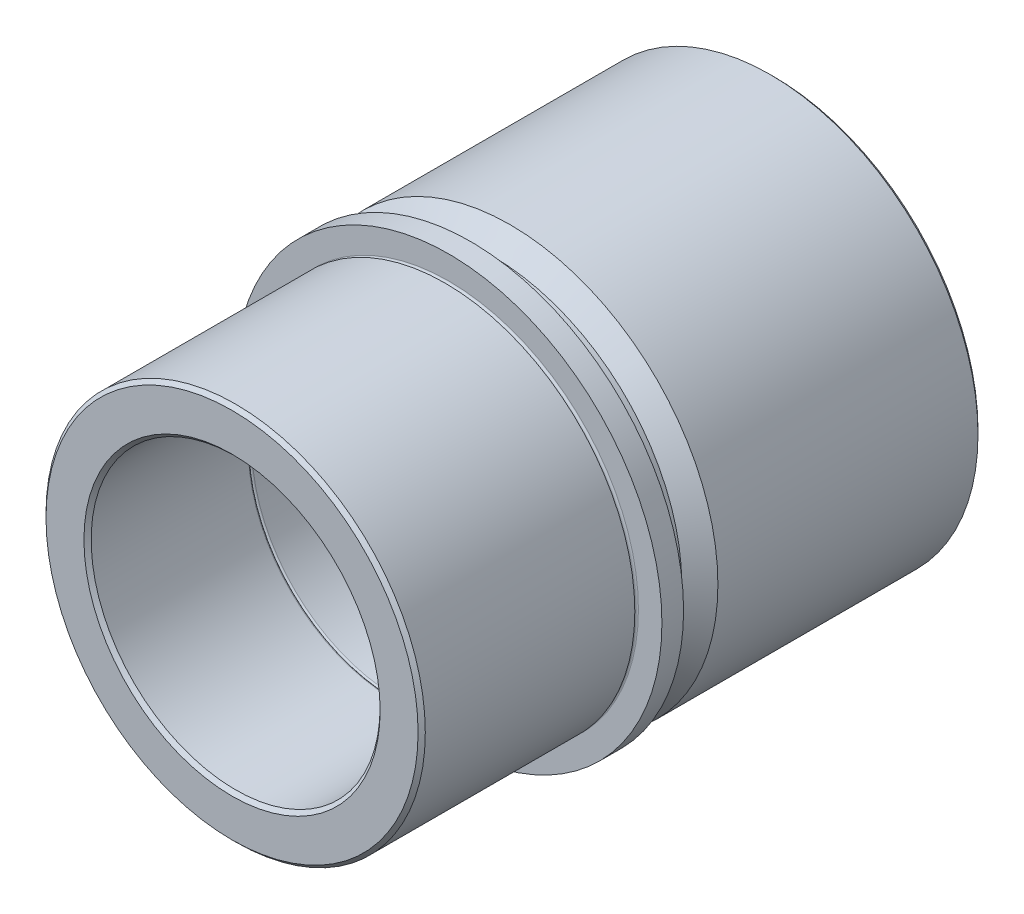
ISO-10303-21;
HEADER;
FILE_DESCRIPTION(('STEP AP214'),'2;1');
FILE_NAME('part.step','',(''),(''),'','','');
FILE_SCHEMA(('AUTOMOTIVE_DESIGN { 1 0 10303 214 1 1 1 1 }'));
ENDSEC;
DATA;
#1=APPLICATION_CONTEXT('core data for automotive mechanical design processes');
#2=APPLICATION_PROTOCOL_DEFINITION('international standard','automotive_design',2000,#1);
#3=PRODUCT_CONTEXT('',#1,'mechanical');
#4=PRODUCT('Part','Part','',(#3));
#5=PRODUCT_RELATED_PRODUCT_CATEGORY('part','',(#4));
#6=PRODUCT_DEFINITION_FORMATION('','',#4);
#7=PRODUCT_DEFINITION_CONTEXT('part definition',#1,'design');
#8=PRODUCT_DEFINITION('design','',#6,#7);
#9=PRODUCT_DEFINITION_SHAPE('','',#8);
#10=(LENGTH_UNIT() NAMED_UNIT(*) SI_UNIT(.MILLI.,.METRE.));
#11=(NAMED_UNIT(*) PLANE_ANGLE_UNIT() SI_UNIT($,.RADIAN.));
#12=(NAMED_UNIT(*) SI_UNIT($,.STERADIAN.) SOLID_ANGLE_UNIT());
#13=UNCERTAINTY_MEASURE_WITH_UNIT(LENGTH_MEASURE(1.E-05),#10,'distance_accuracy_value','');
#14=(GEOMETRIC_REPRESENTATION_CONTEXT(3) GLOBAL_UNCERTAINTY_ASSIGNED_CONTEXT((#13)) GLOBAL_UNIT_ASSIGNED_CONTEXT((#10,
#11,#12)) REPRESENTATION_CONTEXT('',''));
#15=CARTESIAN_POINT('',(0.,0.,0.));
#16=DIRECTION('',(0.,0.,1.));
#17=DIRECTION('',(1.,0.,0.));
#18=AXIS2_PLACEMENT_3D('',#15,#16,#17);
#19=CARTESIAN_POINT('',(0.,0.,-109.5));
#20=DIRECTION('',(0.,0.,1.));
#21=DIRECTION('',(1.,0.,0.));
#22=AXIS2_PLACEMENT_3D('',#19,#20,#21);
#23=TOROIDAL_SURFACE('',#22,40.5,0.5);
#24=CARTESIAN_POINT('',(0.,0.,-109.5));
#25=DIRECTION('',(0.,0.,1.));
#26=DIRECTION('',(1.,0.,0.));
#27=AXIS2_PLACEMENT_3D('',#24,#25,#26);
#28=CIRCLE('',#27,40.);
#29=CARTESIAN_POINT('',(40.,0.,-109.5));
#30=VERTEX_POINT('',#29);
#31=EDGE_CURVE('E81',#30,#30,#28,.T.);
#32=ORIENTED_EDGE('',*,*,#31,.T.);
#33=EDGE_LOOP('',(#32));
#34=FACE_BOUND('',#33,.T.);
#35=CARTESIAN_POINT('',(0.,0.,-110.));
#36=DIRECTION('',(0.,0.,1.));
#37=DIRECTION('',(1.,0.,0.));
#38=AXIS2_PLACEMENT_3D('',#35,#36,#37);
#39=CIRCLE('',#38,40.5);
#40=CARTESIAN_POINT('',(40.5,0.,-110.));
#41=VERTEX_POINT('',#40);
#42=EDGE_CURVE('E45',#41,#41,#39,.T.);
#43=ORIENTED_EDGE('',*,*,#42,.F.);
#44=EDGE_LOOP('',(#43));
#45=FACE_BOUND('',#44,.T.);
#46=ADVANCED_FACE('F13',(#34,#45),#23,.T.);
#47=CARTESIAN_POINT('',(0.,0.,-110.5));
#48=DIRECTION('',(0.,0.,1.));
#49=DIRECTION('',(1.,0.,0.));
#50=AXIS2_PLACEMENT_3D('',#47,#48,#49);
#51=TOROIDAL_SURFACE('',#50,40.5,0.5);
#52=CARTESIAN_POINT('',(0.,0.,-110.5));
#53=DIRECTION('',(0.,0.,1.));
#54=DIRECTION('',(1.,0.,0.));
#55=AXIS2_PLACEMENT_3D('',#52,#53,#54);
#56=CIRCLE('',#55,40.);
#57=CARTESIAN_POINT('',(40.,0.,-110.5));
#58=VERTEX_POINT('',#57);
#59=EDGE_CURVE('E48',#58,#58,#56,.T.);
#60=ORIENTED_EDGE('',*,*,#59,.F.);
#61=EDGE_LOOP('',(#60));
#62=FACE_BOUND('',#61,.T.);
#63=ORIENTED_EDGE('',*,*,#42,.T.);
#64=EDGE_LOOP('',(#63));
#65=FACE_BOUND('',#64,.T.);
#66=ADVANCED_FACE('F113',(#62,#65),#51,.T.);
#67=CARTESIAN_POINT('',(0.,0.,0.));
#68=DIRECTION('',(0.,0.,1.));
#69=DIRECTION('',(1.,0.,0.));
#70=AXIS2_PLACEMENT_3D('',#67,#68,#69);
#71=CYLINDRICAL_SURFACE('',#70,40.);
#72=CARTESIAN_POINT('',(0.,0.,-149.));
#73=DIRECTION('',(0.,0.,1.));
#74=DIRECTION('',(1.,0.,0.));
#75=AXIS2_PLACEMENT_3D('',#72,#73,#74);
#76=CIRCLE('',#75,40.);
#77=CARTESIAN_POINT('',(40.,0.,-149.));
#78=VERTEX_POINT('',#77);
#79=EDGE_CURVE('E36',#78,#78,#76,.F.);
#80=ORIENTED_EDGE('',*,*,#79,.T.);
#81=EDGE_LOOP('',(#80));
#82=FACE_BOUND('',#81,.T.);
#83=ORIENTED_EDGE('',*,*,#59,.T.);
#84=EDGE_LOOP('',(#83));
#85=FACE_BOUND('',#84,.T.);
#86=ADVANCED_FACE('F118',(#82,#85),#71,.F.);
#87=CARTESIAN_POINT('',(0.,0.,-150.));
#88=DIRECTION('',(0.,0.,1.));
#89=DIRECTION('',(1.,0.,0.));
#90=AXIS2_PLACEMENT_3D('',#87,#88,#89);
#91=PLANE('',#90);
#92=CARTESIAN_POINT('',(0.,0.,-150.));
#93=DIRECTION('',(0.,0.,1.));
#94=DIRECTION('',(1.,0.,0.));
#95=AXIS2_PLACEMENT_3D('',#92,#93,#94);
#96=CIRCLE('',#95,41.);
#97=CARTESIAN_POINT('',(41.,0.,-150.));
#98=VERTEX_POINT('',#97);
#99=EDGE_CURVE('E39',#98,#98,#96,.T.);
#100=ORIENTED_EDGE('',*,*,#99,.T.);
#101=EDGE_LOOP('',(#100));
#102=FACE_BOUND('',#101,.T.);
#103=CARTESIAN_POINT('',(0.,0.,-150.));
#104=DIRECTION('',(0.,0.,1.));
#105=DIRECTION('',(1.,0.,0.));
#106=AXIS2_PLACEMENT_3D('',#103,#104,#105);
#107=CIRCLE('',#106,56.5);
#108=CARTESIAN_POINT('',(56.5,0.,-150.));
#109=VERTEX_POINT('',#108);
#110=EDGE_CURVE('E42',#109,#109,#107,.F.);
#111=ORIENTED_EDGE('',*,*,#110,.T.);
#112=EDGE_LOOP('',(#111));
#113=FACE_BOUND('',#112,.T.);
#114=ADVANCED_FACE('F185',(#102,#113),#91,.F.);
#115=CARTESIAN_POINT('',(0.,0.,0.));
#116=DIRECTION('',(0.,0.,1.));
#117=DIRECTION('',(1.,0.,0.));
#118=AXIS2_PLACEMENT_3D('',#115,#116,#117);
#119=CYLINDRICAL_SURFACE('',#118,57.5);
#120=CARTESIAN_POINT('',(0.,0.,-149.));
#121=DIRECTION('',(0.,0.,1.));
#122=DIRECTION('',(1.,0.,0.));
#123=AXIS2_PLACEMENT_3D('',#120,#121,#122);
#124=CIRCLE('',#123,57.5);
#125=CARTESIAN_POINT('',(57.5,0.,-149.));
#126=VERTEX_POINT('',#125);
#127=EDGE_CURVE('E33',#126,#126,#124,.T.);
#128=ORIENTED_EDGE('',*,*,#127,.T.);
#129=EDGE_LOOP('',(#128));
#130=FACE_BOUND('',#129,.T.);
#131=CARTESIAN_POINT('',(0.,0.,-77.));
#132=DIRECTION('',(0.,0.,1.));
#133=DIRECTION('',(1.,0.,0.));
#134=AXIS2_PLACEMENT_3D('',#131,#132,#133);
#135=CIRCLE('',#134,57.5);
#136=CARTESIAN_POINT('',(57.5,0.,-77.));
#137=VERTEX_POINT('',#136);
#138=EDGE_CURVE('E51',#137,#137,#135,.T.);
#139=ORIENTED_EDGE('',*,*,#138,.F.);
#140=EDGE_LOOP('',(#139));
#141=FACE_BOUND('',#140,.T.);
#142=ADVANCED_FACE('F181',(#130,#141),#119,.T.);
#143=CARTESIAN_POINT('',(0.,0.,-72.));
#144=DIRECTION('',(0.,0.,-1.));
#145=DIRECTION('',(-1.,0.,0.));
#146=AXIS2_PLACEMENT_3D('',#143,#144,#145);
#147=CONICAL_SURFACE('',#146,52.5,0.78539816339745);
#148=ORIENTED_EDGE('',*,*,#138,.T.);
#149=EDGE_LOOP('',(#148));
#150=FACE_BOUND('',#149,.T.);
#151=CARTESIAN_POINT('',(0.,0.,-72.));
#152=DIRECTION('',(0.,0.,1.));
#153=DIRECTION('',(1.,0.,0.));
#154=AXIS2_PLACEMENT_3D('',#151,#152,#153);
#155=CIRCLE('',#154,52.5);
#156=CARTESIAN_POINT('',(52.5,0.,-72.));
#157=VERTEX_POINT('',#156);
#158=EDGE_CURVE('E54',#157,#157,#155,.T.);
#159=ORIENTED_EDGE('',*,*,#158,.F.);
#160=EDGE_LOOP('',(#159));
#161=FACE_BOUND('',#160,.T.);
#162=ADVANCED_FACE('F177',(#150,#161),#147,.T.);
#163=CARTESIAN_POINT('',(0.,0.,0.));
#164=DIRECTION('',(0.,0.,1.));
#165=DIRECTION('',(1.,0.,0.));
#166=AXIS2_PLACEMENT_3D('',#163,#164,#165);
#167=CYLINDRICAL_SURFACE('',#166,52.5);
#168=ORIENTED_EDGE('',*,*,#158,.T.);
#169=EDGE_LOOP('',(#168));
#170=FACE_BOUND('',#169,.T.);
#171=CARTESIAN_POINT('',(0.,0.,-66.));
#172=DIRECTION('',(0.,0.,1.));
#173=DIRECTION('',(1.,0.,0.));
#174=AXIS2_PLACEMENT_3D('',#171,#172,#173);
#175=CIRCLE('',#174,52.5);
#176=CARTESIAN_POINT('',(52.5,0.,-66.));
#177=VERTEX_POINT('',#176);
#178=EDGE_CURVE('E57',#177,#177,#175,.T.);
#179=ORIENTED_EDGE('',*,*,#178,.F.);
#180=EDGE_LOOP('',(#179));
#181=FACE_BOUND('',#180,.T.);
#182=ADVANCED_FACE('F173',(#170,#181),#167,.T.);
#183=CARTESIAN_POINT('',(0.,0.,-66.));
#184=DIRECTION('',(0.,0.,-1.));
#185=DIRECTION('',(-1.,0.,0.));
#186=AXIS2_PLACEMENT_3D('',#183,#184,#185);
#187=PLANE('',#186);
#188=ORIENTED_EDGE('',*,*,#178,.T.);
#189=EDGE_LOOP('',(#188));
#190=FACE_BOUND('',#189,.T.);
#191=CARTESIAN_POINT('',(0.,0.,-66.));
#192=DIRECTION('',(0.,0.,1.));
#193=DIRECTION('',(1.,0.,0.));
#194=AXIS2_PLACEMENT_3D('',#191,#192,#193);
#195=CIRCLE('',#194,59.);
#196=CARTESIAN_POINT('',(59.,0.,-66.));
#197=VERTEX_POINT('',#196);
#198=EDGE_CURVE('E60',#197,#197,#195,.T.);
#199=ORIENTED_EDGE('',*,*,#198,.F.);
#200=EDGE_LOOP('',(#199));
#201=FACE_BOUND('',#200,.T.);
#202=ADVANCED_FACE('F169',(#190,#201),#187,.T.);
#203=CARTESIAN_POINT('',(0.,0.,0.));
#204=DIRECTION('',(0.,0.,1.));
#205=DIRECTION('',(1.,0.,0.));
#206=AXIS2_PLACEMENT_3D('',#203,#204,#205);
#207=CYLINDRICAL_SURFACE('',#206,59.);
#208=ORIENTED_EDGE('',*,*,#198,.T.);
#209=EDGE_LOOP('',(#208));
#210=FACE_BOUND('',#209,.T.);
#211=CARTESIAN_POINT('',(0.,0.,-60.));
#212=DIRECTION('',(0.,0.,1.));
#213=DIRECTION('',(1.,0.,0.));
#214=AXIS2_PLACEMENT_3D('',#211,#212,#213);
#215=CIRCLE('',#214,59.);
#216=CARTESIAN_POINT('',(59.,0.,-60.));
#217=VERTEX_POINT('',#216);
#218=EDGE_CURVE('E63',#217,#217,#215,.T.);
#219=ORIENTED_EDGE('',*,*,#218,.F.);
#220=EDGE_LOOP('',(#219));
#221=FACE_BOUND('',#220,.T.);
#222=ADVANCED_FACE('F165',(#210,#221),#207,.T.);
#223=CARTESIAN_POINT('',(0.,0.,-60.));
#224=DIRECTION('',(0.,0.,1.));
#225=DIRECTION('',(1.,0.,0.));
#226=AXIS2_PLACEMENT_3D('',#223,#224,#225);
#227=PLANE('',#226);
#228=ORIENTED_EDGE('',*,*,#218,.T.);
#229=EDGE_LOOP('',(#228));
#230=FACE_BOUND('',#229,.T.);
#231=CARTESIAN_POINT('',(0.,0.,-60.));
#232=DIRECTION('',(0.,0.,1.));
#233=DIRECTION('',(1.,0.,0.));
#234=AXIS2_PLACEMENT_3D('',#231,#232,#233);
#235=CIRCLE('',#234,52.5);
#236=CARTESIAN_POINT('',(52.5,0.,-60.));
#237=VERTEX_POINT('',#236);
#238=EDGE_CURVE('E66',#237,#237,#235,.T.);
#239=ORIENTED_EDGE('',*,*,#238,.F.);
#240=EDGE_LOOP('',(#239));
#241=FACE_BOUND('',#240,.T.);
#242=ADVANCED_FACE('F161',(#230,#241),#227,.T.);
#243=CARTESIAN_POINT('',(0.,0.,-59.5));
#244=DIRECTION('',(0.,0.,1.));
#245=DIRECTION('',(1.,0.,0.));
#246=AXIS2_PLACEMENT_3D('',#243,#244,#245);
#247=TOROIDAL_SURFACE('',#246,52.5,0.5);
#248=ORIENTED_EDGE('',*,*,#238,.T.);
#249=EDGE_LOOP('',(#248));
#250=FACE_BOUND('',#249,.T.);
#251=CARTESIAN_POINT('',(0.,0.,-59.));
#252=DIRECTION('',(0.,0.,1.));
#253=DIRECTION('',(1.,0.,0.));
#254=AXIS2_PLACEMENT_3D('',#251,#252,#253);
#255=CIRCLE('',#254,52.5);
#256=CARTESIAN_POINT('',(52.5,0.,-59.));
#257=VERTEX_POINT('',#256);
#258=EDGE_CURVE('E69',#257,#257,#255,.T.);
#259=ORIENTED_EDGE('',*,*,#258,.F.);
#260=EDGE_LOOP('',(#259));
#261=FACE_BOUND('',#260,.T.);
#262=ADVANCED_FACE('F156',(#250,#261),#247,.F.);
#263=CARTESIAN_POINT('',(0.,0.,0.));
#264=DIRECTION('',(0.,0.,1.));
#265=DIRECTION('',(1.,0.,0.));
#266=AXIS2_PLACEMENT_3D('',#263,#264,#265);
#267=CYLINDRICAL_SURFACE('',#266,52.5);
#268=CARTESIAN_POINT('',(0.,0.,-1.00000000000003));
#269=DIRECTION('',(0.,0.,1.));
#270=DIRECTION('',(1.,0.,0.));
#271=AXIS2_PLACEMENT_3D('',#268,#269,#270);
#272=CIRCLE('',#271,52.5);
#273=CARTESIAN_POINT('',(52.5,0.,-1.00000000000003));
#274=VERTEX_POINT('',#273);
#275=EDGE_CURVE('E8',#274,#274,#272,.F.);
#276=ORIENTED_EDGE('',*,*,#275,.T.);
#277=EDGE_LOOP('',(#276));
#278=FACE_BOUND('',#277,.T.);
#279=ORIENTED_EDGE('',*,*,#258,.T.);
#280=EDGE_LOOP('',(#279));
#281=FACE_BOUND('',#280,.T.);
#282=ADVANCED_FACE('F149',(#278,#281),#267,.T.);
#283=CARTESIAN_POINT('',(0.,0.,0.));
#284=DIRECTION('',(0.,0.,1.));
#285=DIRECTION('',(1.,0.,0.));
#286=AXIS2_PLACEMENT_3D('',#283,#284,#285);
#287=PLANE('',#286);
#288=CARTESIAN_POINT('',(0.,0.,0.));
#289=DIRECTION('',(0.,0.,1.));
#290=DIRECTION('',(1.,0.,0.));
#291=AXIS2_PLACEMENT_3D('',#288,#289,#290);
#292=CIRCLE('',#291,41.);
#293=CARTESIAN_POINT('',(41.,0.,0.));
#294=VERTEX_POINT('',#293);
#295=EDGE_CURVE('E20',#294,#294,#292,.F.);
#296=ORIENTED_EDGE('',*,*,#295,.T.);
#297=EDGE_LOOP('',(#296));
#298=FACE_BOUND('',#297,.T.);
#299=CARTESIAN_POINT('',(0.,0.,0.));
#300=DIRECTION('',(0.,0.,1.));
#301=DIRECTION('',(1.,0.,0.));
#302=AXIS2_PLACEMENT_3D('',#299,#300,#301);
#303=CIRCLE('',#302,51.5);
#304=CARTESIAN_POINT('',(51.5,0.,0.));
#305=VERTEX_POINT('',#304);
#306=EDGE_CURVE('E24',#305,#305,#303,.T.);
#307=ORIENTED_EDGE('',*,*,#306,.T.);
#308=EDGE_LOOP('',(#307));
#309=FACE_BOUND('',#308,.T.);
#310=ADVANCED_FACE('F109',(#298,#309),#287,.T.);
#311=CARTESIAN_POINT('',(0.,0.,0.));
#312=DIRECTION('',(0.,0.,1.));
#313=DIRECTION('',(1.,0.,0.));
#314=AXIS2_PLACEMENT_3D('',#311,#312,#313);
#315=CYLINDRICAL_SURFACE('',#314,40.);
#316=CARTESIAN_POINT('',(0.,0.,-0.99999999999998));
#317=DIRECTION('',(0.,0.,1.));
#318=DIRECTION('',(1.,0.,0.));
#319=AXIS2_PLACEMENT_3D('',#316,#317,#318);
#320=CIRCLE('',#319,40.);
#321=CARTESIAN_POINT('',(40.,0.,-0.99999999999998));
#322=VERTEX_POINT('',#321);
#323=EDGE_CURVE('E28',#322,#322,#320,.T.);
#324=ORIENTED_EDGE('',*,*,#323,.T.);
#325=EDGE_LOOP('',(#324));
#326=FACE_BOUND('',#325,.T.);
#327=CARTESIAN_POINT('',(0.,0.,-44.5));
#328=DIRECTION('',(0.,0.,1.));
#329=DIRECTION('',(1.,0.,0.));
#330=AXIS2_PLACEMENT_3D('',#327,#328,#329);
#331=CIRCLE('',#330,40.);
#332=CARTESIAN_POINT('',(40.,0.,-44.5));
#333=VERTEX_POINT('',#332);
#334=EDGE_CURVE('E72',#333,#333,#331,.T.);
#335=ORIENTED_EDGE('',*,*,#334,.F.);
#336=EDGE_LOOP('',(#335));
#337=FACE_BOUND('',#336,.T.);
#338=ADVANCED_FACE('F102',(#326,#337),#315,.F.);
#339=CARTESIAN_POINT('',(0.,0.,-44.5));
#340=DIRECTION('',(0.,0.,1.));
#341=DIRECTION('',(1.,0.,0.));
#342=AXIS2_PLACEMENT_3D('',#339,#340,#341);
#343=TOROIDAL_SURFACE('',#342,40.5,0.5);
#344=ORIENTED_EDGE('',*,*,#334,.T.);
#345=EDGE_LOOP('',(#344));
#346=FACE_BOUND('',#345,.T.);
#347=CARTESIAN_POINT('',(0.,0.,-45.));
#348=DIRECTION('',(0.,0.,1.));
#349=DIRECTION('',(1.,0.,0.));
#350=AXIS2_PLACEMENT_3D('',#347,#348,#349);
#351=CIRCLE('',#350,40.5);
#352=CARTESIAN_POINT('',(40.5,0.,-45.));
#353=VERTEX_POINT('',#352);
#354=EDGE_CURVE('E75',#353,#353,#351,.T.);
#355=ORIENTED_EDGE('',*,*,#354,.F.);
#356=EDGE_LOOP('',(#355));
#357=FACE_BOUND('',#356,.T.);
#358=ADVANCED_FACE('F97',(#346,#357),#343,.T.);
#359=CARTESIAN_POINT('',(0.,0.,-45.5));
#360=DIRECTION('',(0.,0.,1.));
#361=DIRECTION('',(1.,0.,0.));
#362=AXIS2_PLACEMENT_3D('',#359,#360,#361);
#363=TOROIDAL_SURFACE('',#362,40.5,0.5);
#364=CARTESIAN_POINT('',(0.,0.,-45.5));
#365=DIRECTION('',(0.,0.,1.));
#366=DIRECTION('',(1.,0.,0.));
#367=AXIS2_PLACEMENT_3D('',#364,#365,#366);
#368=CIRCLE('',#367,40.);
#369=CARTESIAN_POINT('',(40.,0.,-45.5));
#370=VERTEX_POINT('',#369);
#371=EDGE_CURVE('E78',#370,#370,#368,.T.);
#372=ORIENTED_EDGE('',*,*,#371,.F.);
#373=EDGE_LOOP('',(#372));
#374=FACE_BOUND('',#373,.T.);
#375=ORIENTED_EDGE('',*,*,#354,.T.);
#376=EDGE_LOOP('',(#375));
#377=FACE_BOUND('',#376,.T.);
#378=ADVANCED_FACE('F91',(#374,#377),#363,.T.);
#379=CARTESIAN_POINT('',(0.,0.,0.));
#380=DIRECTION('',(0.,0.,1.));
#381=DIRECTION('',(1.,0.,0.));
#382=AXIS2_PLACEMENT_3D('',#379,#380,#381);
#383=CYLINDRICAL_SURFACE('',#382,40.);
#384=ORIENTED_EDGE('',*,*,#31,.F.);
#385=EDGE_LOOP('',(#384));
#386=FACE_BOUND('',#385,.T.);
#387=ORIENTED_EDGE('',*,*,#371,.T.);
#388=EDGE_LOOP('',(#387));
#389=FACE_BOUND('',#388,.T.);
#390=ADVANCED_FACE('F87',(#386,#389),#383,.F.);
#391=CARTESIAN_POINT('',(0.,0.,-150.));
#392=DIRECTION('',(0.,0.,-1.));
#393=DIRECTION('',(-1.,0.,0.));
#394=AXIS2_PLACEMENT_3D('',#391,#392,#393);
#395=CONICAL_SURFACE('',#394,41.,0.785398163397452);
#396=ORIENTED_EDGE('',*,*,#79,.F.);
#397=EDGE_LOOP('',(#396));
#398=FACE_BOUND('',#397,.T.);
#399=ORIENTED_EDGE('',*,*,#99,.F.);
#400=EDGE_LOOP('',(#399));
#401=FACE_BOUND('',#400,.T.);
#402=ADVANCED_FACE('F90',(#398,#401),#395,.F.);
#403=CARTESIAN_POINT('',(0.,0.,-149.));
#404=DIRECTION('',(0.,0.,1.));
#405=DIRECTION('',(1.,0.,0.));
#406=AXIS2_PLACEMENT_3D('',#403,#404,#405);
#407=CONICAL_SURFACE('',#406,57.5,0.785398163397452);
#408=ORIENTED_EDGE('',*,*,#110,.F.);
#409=EDGE_LOOP('',(#408));
#410=FACE_BOUND('',#409,.T.);
#411=ORIENTED_EDGE('',*,*,#127,.F.);
#412=EDGE_LOOP('',(#411));
#413=FACE_BOUND('',#412,.T.);
#414=ADVANCED_FACE('F125',(#410,#413),#407,.T.);
#415=CARTESIAN_POINT('',(0.,0.,-0.99999999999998));
#416=DIRECTION('',(0.,0.,1.));
#417=DIRECTION('',(1.,0.,0.));
#418=AXIS2_PLACEMENT_3D('',#415,#416,#417);
#419=CONICAL_SURFACE('',#418,40.,0.785398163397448);
#420=ORIENTED_EDGE('',*,*,#295,.F.);
#421=EDGE_LOOP('',(#420));
#422=FACE_BOUND('',#421,.T.);
#423=ORIENTED_EDGE('',*,*,#323,.F.);
#424=EDGE_LOOP('',(#423));
#425=FACE_BOUND('',#424,.T.);
#426=ADVANCED_FACE('F128',(#422,#425),#419,.F.);
#427=CARTESIAN_POINT('',(0.,0.,0.));
#428=DIRECTION('',(0.,0.,-1.));
#429=DIRECTION('',(-1.,0.,0.));
#430=AXIS2_PLACEMENT_3D('',#427,#428,#429);
#431=CONICAL_SURFACE('',#430,51.5,0.785398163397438);
#432=ORIENTED_EDGE('',*,*,#275,.F.);
#433=EDGE_LOOP('',(#432));
#434=FACE_BOUND('',#433,.T.);
#435=ORIENTED_EDGE('',*,*,#306,.F.);
#436=EDGE_LOOP('',(#435));
#437=FACE_BOUND('',#436,.T.);
#438=ADVANCED_FACE('F15',(#434,#437),#431,.T.);
#439=CLOSED_SHELL('',(#46,#66,#86,#114,#142,#162,#182,#202,#222,#242,#262,#282,#310,#338,#358,
#378,#390,#402,#414,#426,#438));
#440=MANIFOLD_SOLID_BREP('B1',#439);
#441=ADVANCED_BREP_SHAPE_REPRESENTATION('',(#18,#440),#14);
#442=SHAPE_DEFINITION_REPRESENTATION(#9,#441);
ENDSEC;
END-ISO-10303-21;
